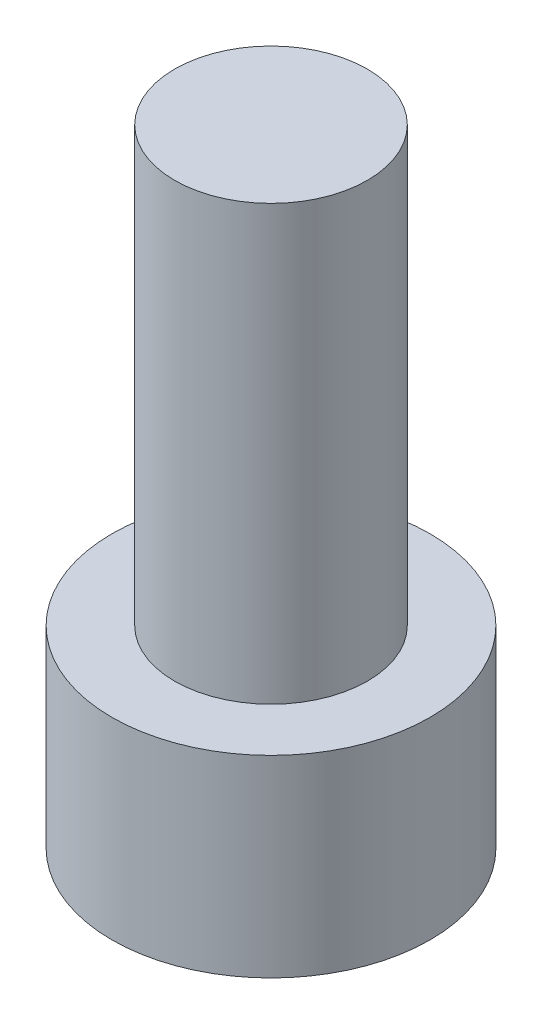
ISO-10303-21;
HEADER;
FILE_DESCRIPTION(('STEP AP214'),'2;1');
FILE_NAME('part.step','',(''),(''),'','','');
FILE_SCHEMA(('AUTOMOTIVE_DESIGN { 1 0 10303 214 1 1 1 1 }'));
ENDSEC;
DATA;
#1=APPLICATION_CONTEXT('core data for automotive mechanical design processes');
#2=APPLICATION_PROTOCOL_DEFINITION('international standard','automotive_design',2000,#1);
#3=PRODUCT_CONTEXT('',#1,'mechanical');
#4=PRODUCT('Part','Part','',(#3));
#5=PRODUCT_RELATED_PRODUCT_CATEGORY('part','',(#4));
#6=PRODUCT_DEFINITION_FORMATION('','',#4);
#7=PRODUCT_DEFINITION_CONTEXT('part definition',#1,'design');
#8=PRODUCT_DEFINITION('design','',#6,#7);
#9=PRODUCT_DEFINITION_SHAPE('','',#8);
#10=(LENGTH_UNIT() NAMED_UNIT(*) SI_UNIT(.MILLI.,.METRE.));
#11=(NAMED_UNIT(*) PLANE_ANGLE_UNIT() SI_UNIT($,.RADIAN.));
#12=(NAMED_UNIT(*) SI_UNIT($,.STERADIAN.) SOLID_ANGLE_UNIT());
#13=UNCERTAINTY_MEASURE_WITH_UNIT(LENGTH_MEASURE(1.E-05),#10,'distance_accuracy_value','');
#14=(GEOMETRIC_REPRESENTATION_CONTEXT(3) GLOBAL_UNCERTAINTY_ASSIGNED_CONTEXT((#13)) GLOBAL_UNIT_ASSIGNED_CONTEXT((#10,
#11,#12)) REPRESENTATION_CONTEXT('',''));
#15=CARTESIAN_POINT('',(0.,0.,0.));
#16=DIRECTION('',(0.,0.,1.));
#17=DIRECTION('',(1.,0.,0.));
#18=AXIS2_PLACEMENT_3D('',#15,#16,#17);
#19=CARTESIAN_POINT('',(0.,8.,0.));
#20=DIRECTION('',(0.,-1.,0.));
#21=DIRECTION('',(0.,0.,-1.));
#22=AXIS2_PLACEMENT_3D('',#19,#20,#21);
#23=CYLINDRICAL_SURFACE('',#22,6.6);
#24=CARTESIAN_POINT('',(0.,8.,0.));
#25=DIRECTION('',(0.,1.,0.));
#26=DIRECTION('',(0.,0.,1.));
#27=AXIS2_PLACEMENT_3D('',#24,#25,#26);
#28=CIRCLE('',#27,6.6);
#29=CARTESIAN_POINT('',(0.,8.,6.6));
#30=VERTEX_POINT('',#29);
#31=EDGE_CURVE('E51',#30,#30,#28,.T.);
#32=ORIENTED_EDGE('',*,*,#31,.F.);
#33=EDGE_LOOP('',(#32));
#34=FACE_BOUND('',#33,.T.);
#35=CARTESIAN_POINT('',(0.,0.,0.));
#36=DIRECTION('',(0.,1.,0.));
#37=DIRECTION('',(0.,0.,1.));
#38=AXIS2_PLACEMENT_3D('',#35,#36,#37);
#39=CIRCLE('',#38,6.6);
#40=CARTESIAN_POINT('',(0.,0.,6.6));
#41=VERTEX_POINT('',#40);
#42=EDGE_CURVE('E46',#41,#41,#39,.T.);
#43=ORIENTED_EDGE('',*,*,#42,.T.);
#44=EDGE_LOOP('',(#43));
#45=FACE_BOUND('',#44,.T.);
#46=ADVANCED_FACE('F43',(#34,#45),#23,.T.);
#47=CARTESIAN_POINT('',(0.,8.,0.));
#48=DIRECTION('',(0.,1.,0.));
#49=DIRECTION('',(0.,0.,1.));
#50=AXIS2_PLACEMENT_3D('',#47,#48,#49);
#51=PLANE('',#50);
#52=CARTESIAN_POINT('',(0.,8.,0.));
#53=DIRECTION('',(0.,1.,0.));
#54=DIRECTION('',(0.,0.,1.));
#55=AXIS2_PLACEMENT_3D('',#52,#53,#54);
#56=CIRCLE('',#55,4.);
#57=CARTESIAN_POINT('',(0.,8.,4.));
#58=VERTEX_POINT('',#57);
#59=EDGE_CURVE('E11',#58,#58,#56,.T.);
#60=ORIENTED_EDGE('',*,*,#59,.F.);
#61=EDGE_LOOP('',(#60));
#62=FACE_BOUND('',#61,.T.);
#63=ORIENTED_EDGE('',*,*,#31,.T.);
#64=EDGE_LOOP('',(#63));
#65=FACE_BOUND('',#64,.T.);
#66=ADVANCED_FACE('F161',(#62,#65),#51,.T.);
#67=CARTESIAN_POINT('',(0.,0.,0.));
#68=DIRECTION('',(0.,1.,0.));
#69=DIRECTION('',(0.,0.,1.));
#70=AXIS2_PLACEMENT_3D('',#67,#68,#69);
#71=PLANE('',#70);
#72=DIRECTION('',(-0.538335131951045,0.,0.842730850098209));
#73=VECTOR('',#72,1.);
#74=CARTESIAN_POINT('',(3.46061635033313,0.,0.155352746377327));
#75=LINE('',#74,#73);
#76=CARTESIAN_POINT('',(3.46061635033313,0.,0.155352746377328));
#77=VERTEX_POINT('',#76);
#78=CARTESIAN_POINT('',(1.59576875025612,0.,3.07465804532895));
#79=VERTEX_POINT('',#78);
#80=EDGE_CURVE('E132',#77,#79,#75,.T.);
#81=ORIENTED_EDGE('',*,*,#80,.F.);
#82=DIRECTION('',(0.460658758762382,0.,0.887577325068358));
#83=VECTOR('',#82,1.);
#84=CARTESIAN_POINT('',(1.86484760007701,0.,-2.91930529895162));
#85=LINE('',#84,#83);
#86=CARTESIAN_POINT('',(1.86484760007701,0.,-2.91930529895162));
#87=VERTEX_POINT('',#86);
#88=EDGE_CURVE('E56',#87,#77,#85,.T.);
#89=ORIENTED_EDGE('',*,*,#88,.F.);
#90=DIRECTION('',(0.998993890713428,0.,0.0448464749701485));
#91=VECTOR('',#90,1.);
#92=CARTESIAN_POINT('',(-1.59576875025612,0.,-3.07465804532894));
#93=LINE('',#92,#91);
#94=CARTESIAN_POINT('',(-1.59576875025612,0.,-3.07465804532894));
#95=VERTEX_POINT('',#94);
#96=EDGE_CURVE('E145',#95,#87,#93,.T.);
#97=ORIENTED_EDGE('',*,*,#96,.F.);
#98=DIRECTION('',(0.538335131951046,0.,-0.842730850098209));
#99=VECTOR('',#98,1.);
#100=CARTESIAN_POINT('',(-3.46061635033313,0.,-0.155352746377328));
#101=LINE('',#100,#99);
#102=CARTESIAN_POINT('',(-3.46061635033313,0.,-0.155352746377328));
#103=VERTEX_POINT('',#102);
#104=EDGE_CURVE('E139',#103,#95,#101,.T.);
#105=ORIENTED_EDGE('',*,*,#104,.F.);
#106=DIRECTION('',(-0.460658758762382,0.,-0.887577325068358));
#107=VECTOR('',#106,1.);
#108=CARTESIAN_POINT('',(-1.86484760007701,0.,2.91930529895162));
#109=LINE('',#108,#107);
#110=CARTESIAN_POINT('',(-1.86484760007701,0.,2.91930529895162));
#111=VERTEX_POINT('',#110);
#112=EDGE_CURVE('E110',#111,#103,#109,.T.);
#113=ORIENTED_EDGE('',*,*,#112,.F.);
#114=DIRECTION('',(-0.998993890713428,0.,-0.0448464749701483));
#115=VECTOR('',#114,1.);
#116=CARTESIAN_POINT('',(1.59576875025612,0.,3.07465804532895));
#117=LINE('',#116,#115);
#118=EDGE_CURVE('E136',#79,#111,#117,.T.);
#119=ORIENTED_EDGE('',*,*,#118,.F.);
#120=EDGE_LOOP('',(#81,#89,#97,#105,#113,#119));
#121=FACE_BOUND('',#120,.T.);
#122=ORIENTED_EDGE('',*,*,#42,.F.);
#123=EDGE_LOOP('',(#122));
#124=FACE_BOUND('',#123,.T.);
#125=ADVANCED_FACE('F159',(#121,#124),#71,.F.);
#126=CARTESIAN_POINT('',(0.,26.,0.));
#127=DIRECTION('',(0.,-1.,0.));
#128=DIRECTION('',(0.,0.,-1.));
#129=AXIS2_PLACEMENT_3D('',#126,#127,#128);
#130=CYLINDRICAL_SURFACE('',#129,4.);
#131=CARTESIAN_POINT('',(0.,26.,0.));
#132=DIRECTION('',(0.,1.,0.));
#133=DIRECTION('',(0.,0.,1.));
#134=AXIS2_PLACEMENT_3D('',#131,#132,#133);
#135=CIRCLE('',#134,4.);
#136=CARTESIAN_POINT('',(0.,26.,4.));
#137=VERTEX_POINT('',#136);
#138=EDGE_CURVE('E147',#137,#137,#135,.T.);
#139=ORIENTED_EDGE('',*,*,#138,.F.);
#140=EDGE_LOOP('',(#139));
#141=FACE_BOUND('',#140,.T.);
#142=ORIENTED_EDGE('',*,*,#59,.T.);
#143=EDGE_LOOP('',(#142));
#144=FACE_BOUND('',#143,.T.);
#145=ADVANCED_FACE('F162',(#141,#144),#130,.T.);
#146=CARTESIAN_POINT('',(0.,26.,0.));
#147=DIRECTION('',(0.,1.,0.));
#148=DIRECTION('',(0.,0.,1.));
#149=AXIS2_PLACEMENT_3D('',#146,#147,#148);
#150=PLANE('',#149);
#151=ORIENTED_EDGE('',*,*,#138,.T.);
#152=EDGE_LOOP('',(#151));
#153=FACE_BOUND('',#152,.T.);
#154=ADVANCED_FACE('F167',(#153),#150,.T.);
#155=CARTESIAN_POINT('',(1.86484760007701,4.,-2.91930529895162));
#156=DIRECTION('',(0.887577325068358,0.,-0.460658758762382));
#157=DIRECTION('',(-0.460658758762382,0.,-0.887577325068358));
#158=AXIS2_PLACEMENT_3D('',#155,#156,#157);
#159=PLANE('',#158);
#160=ORIENTED_EDGE('',*,*,#88,.T.);
#161=DIRECTION('',(0.,-1.,0.));
#162=VECTOR('',#161,1.);
#163=CARTESIAN_POINT('',(3.46061635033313,4.,0.155352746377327));
#164=LINE('',#163,#162);
#165=CARTESIAN_POINT('',(3.46061635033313,4.,0.155352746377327));
#166=VERTEX_POINT('',#165);
#167=EDGE_CURVE('E90',#166,#77,#164,.T.);
#168=ORIENTED_EDGE('',*,*,#167,.F.);
#169=DIRECTION('',(0.460658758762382,0.,0.887577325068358));
#170=VECTOR('',#169,1.);
#171=CARTESIAN_POINT('',(1.86484760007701,4.,-2.91930529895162));
#172=LINE('',#171,#170);
#173=CARTESIAN_POINT('',(1.86484760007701,4.,-2.91930529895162));
#174=VERTEX_POINT('',#173);
#175=EDGE_CURVE('E144',#174,#166,#172,.T.);
#176=ORIENTED_EDGE('',*,*,#175,.F.);
#177=DIRECTION('',(0.,-1.,0.));
#178=VECTOR('',#177,1.);
#179=CARTESIAN_POINT('',(1.86484760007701,4.,-2.91930529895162));
#180=LINE('',#179,#178);
#181=EDGE_CURVE('E69',#174,#87,#180,.T.);
#182=ORIENTED_EDGE('',*,*,#181,.T.);
#183=EDGE_LOOP('',(#160,#168,#176,#182));
#184=FACE_BOUND('',#183,.T.);
#185=ADVANCED_FACE('F197',(#184),#159,.F.);
#186=CARTESIAN_POINT('',(-1.59576875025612,4.,-3.07465804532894));
#187=DIRECTION('',(0.0448464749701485,0.,-0.998993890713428));
#188=DIRECTION('',(-0.998993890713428,0.,-0.0448464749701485));
#189=AXIS2_PLACEMENT_3D('',#186,#187,#188);
#190=PLANE('',#189);
#191=ORIENTED_EDGE('',*,*,#96,.T.);
#192=ORIENTED_EDGE('',*,*,#181,.F.);
#193=DIRECTION('',(0.998993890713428,0.,0.0448464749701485));
#194=VECTOR('',#193,1.);
#195=CARTESIAN_POINT('',(-1.59576875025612,4.,-3.07465804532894));
#196=LINE('',#195,#194);
#197=CARTESIAN_POINT('',(-1.59576875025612,4.,-3.07465804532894));
#198=VERTEX_POINT('',#197);
#199=EDGE_CURVE('E118',#198,#174,#196,.T.);
#200=ORIENTED_EDGE('',*,*,#199,.F.);
#201=DIRECTION('',(0.,-1.,0.));
#202=VECTOR('',#201,1.);
#203=CARTESIAN_POINT('',(-1.59576875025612,4.,-3.07465804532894));
#204=LINE('',#203,#202);
#205=EDGE_CURVE('E111',#198,#95,#204,.T.);
#206=ORIENTED_EDGE('',*,*,#205,.T.);
#207=EDGE_LOOP('',(#191,#192,#200,#206));
#208=FACE_BOUND('',#207,.T.);
#209=ADVANCED_FACE('F208',(#208),#190,.F.);
#210=CARTESIAN_POINT('',(-3.46061635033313,4.,-0.155352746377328));
#211=DIRECTION('',(-0.842730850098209,0.,-0.538335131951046));
#212=DIRECTION('',(-0.538335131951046,0.,0.842730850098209));
#213=AXIS2_PLACEMENT_3D('',#210,#211,#212);
#214=PLANE('',#213);
#215=ORIENTED_EDGE('',*,*,#104,.T.);
#216=ORIENTED_EDGE('',*,*,#205,.F.);
#217=DIRECTION('',(0.538335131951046,0.,-0.842730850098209));
#218=VECTOR('',#217,1.);
#219=CARTESIAN_POINT('',(-3.46061635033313,4.,-0.155352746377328));
#220=LINE('',#219,#218);
#221=CARTESIAN_POINT('',(-3.46061635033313,4.,-0.155352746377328));
#222=VERTEX_POINT('',#221);
#223=EDGE_CURVE('E114',#222,#198,#220,.T.);
#224=ORIENTED_EDGE('',*,*,#223,.F.);
#225=DIRECTION('',(0.,-1.,0.));
#226=VECTOR('',#225,1.);
#227=CARTESIAN_POINT('',(-3.46061635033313,4.,-0.155352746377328));
#228=LINE('',#227,#226);
#229=EDGE_CURVE('E99',#222,#103,#228,.T.);
#230=ORIENTED_EDGE('',*,*,#229,.T.);
#231=EDGE_LOOP('',(#215,#216,#224,#230));
#232=FACE_BOUND('',#231,.T.);
#233=ADVANCED_FACE('F116',(#232),#214,.F.);
#234=CARTESIAN_POINT('',(-1.86484760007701,4.,2.91930529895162));
#235=DIRECTION('',(-0.887577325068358,0.,0.460658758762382));
#236=DIRECTION('',(0.460658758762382,0.,0.887577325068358));
#237=AXIS2_PLACEMENT_3D('',#234,#235,#236);
#238=PLANE('',#237);
#239=ORIENTED_EDGE('',*,*,#112,.T.);
#240=ORIENTED_EDGE('',*,*,#229,.F.);
#241=DIRECTION('',(-0.460658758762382,0.,-0.887577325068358));
#242=VECTOR('',#241,1.);
#243=CARTESIAN_POINT('',(-1.86484760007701,4.,2.91930529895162));
#244=LINE('',#243,#242);
#245=CARTESIAN_POINT('',(-1.86484760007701,4.,2.91930529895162));
#246=VERTEX_POINT('',#245);
#247=EDGE_CURVE('E104',#246,#222,#244,.T.);
#248=ORIENTED_EDGE('',*,*,#247,.F.);
#249=DIRECTION('',(0.,-1.,0.));
#250=VECTOR('',#249,1.);
#251=CARTESIAN_POINT('',(-1.86484760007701,4.,2.91930529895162));
#252=LINE('',#251,#250);
#253=EDGE_CURVE('E115',#246,#111,#252,.T.);
#254=ORIENTED_EDGE('',*,*,#253,.T.);
#255=EDGE_LOOP('',(#239,#240,#248,#254));
#256=FACE_BOUND('',#255,.T.);
#257=ADVANCED_FACE('F105',(#256),#238,.F.);
#258=CARTESIAN_POINT('',(1.59576875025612,4.,3.07465804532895));
#259=DIRECTION('',(-0.0448464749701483,0.,0.998993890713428));
#260=DIRECTION('',(0.998993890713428,0.,0.0448464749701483));
#261=AXIS2_PLACEMENT_3D('',#258,#259,#260);
#262=PLANE('',#261);
#263=ORIENTED_EDGE('',*,*,#118,.T.);
#264=ORIENTED_EDGE('',*,*,#253,.F.);
#265=DIRECTION('',(-0.998993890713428,0.,-0.0448464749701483));
#266=VECTOR('',#265,1.);
#267=CARTESIAN_POINT('',(1.59576875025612,4.,3.07465804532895));
#268=LINE('',#267,#266);
#269=CARTESIAN_POINT('',(1.59576875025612,4.,3.07465804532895));
#270=VERTEX_POINT('',#269);
#271=EDGE_CURVE('E123',#270,#246,#268,.T.);
#272=ORIENTED_EDGE('',*,*,#271,.F.);
#273=DIRECTION('',(0.,-1.,0.));
#274=VECTOR('',#273,1.);
#275=CARTESIAN_POINT('',(1.59576875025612,4.,3.07465804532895));
#276=LINE('',#275,#274);
#277=EDGE_CURVE('E146',#270,#79,#276,.T.);
#278=ORIENTED_EDGE('',*,*,#277,.T.);
#279=EDGE_LOOP('',(#263,#264,#272,#278));
#280=FACE_BOUND('',#279,.T.);
#281=ADVANCED_FACE('F232',(#280),#262,.F.);
#282=CARTESIAN_POINT('',(3.46061635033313,4.,0.155352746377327));
#283=DIRECTION('',(0.842730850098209,0.,0.538335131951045));
#284=DIRECTION('',(0.538335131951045,0.,-0.842730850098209));
#285=AXIS2_PLACEMENT_3D('',#282,#283,#284);
#286=PLANE('',#285);
#287=ORIENTED_EDGE('',*,*,#80,.T.);
#288=ORIENTED_EDGE('',*,*,#277,.F.);
#289=DIRECTION('',(-0.538335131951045,0.,0.842730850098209));
#290=VECTOR('',#289,1.);
#291=CARTESIAN_POINT('',(3.46061635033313,4.,0.155352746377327));
#292=LINE('',#291,#290);
#293=EDGE_CURVE('E130',#166,#270,#292,.T.);
#294=ORIENTED_EDGE('',*,*,#293,.F.);
#295=ORIENTED_EDGE('',*,*,#167,.T.);
#296=EDGE_LOOP('',(#287,#288,#294,#295));
#297=FACE_BOUND('',#296,.T.);
#298=ADVANCED_FACE('F242',(#297),#286,.F.);
#299=CARTESIAN_POINT('',(0.,4.,0.));
#300=DIRECTION('',(0.,-1.,0.));
#301=DIRECTION('',(0.,0.,-1.));
#302=AXIS2_PLACEMENT_3D('',#299,#300,#301);
#303=PLANE('',#302);
#304=ORIENTED_EDGE('',*,*,#175,.T.);
#305=ORIENTED_EDGE('',*,*,#293,.T.);
#306=ORIENTED_EDGE('',*,*,#271,.T.);
#307=ORIENTED_EDGE('',*,*,#247,.T.);
#308=ORIENTED_EDGE('',*,*,#223,.T.);
#309=ORIENTED_EDGE('',*,*,#199,.T.);
#310=EDGE_LOOP('',(#304,#305,#306,#307,#308,#309));
#311=FACE_BOUND('',#310,.T.);
#312=ADVANCED_FACE('F125',(#311),#303,.T.);
#313=CLOSED_SHELL('',(#46,#66,#125,#145,#154,#185,#209,#233,#257,#281,#298,#312));
#314=MANIFOLD_SOLID_BREP('B2',#313);
#315=ADVANCED_BREP_SHAPE_REPRESENTATION('',(#18,#314),#14);
#316=SHAPE_DEFINITION_REPRESENTATION(#9,#315);
ENDSEC;
END-ISO-10303-21;
